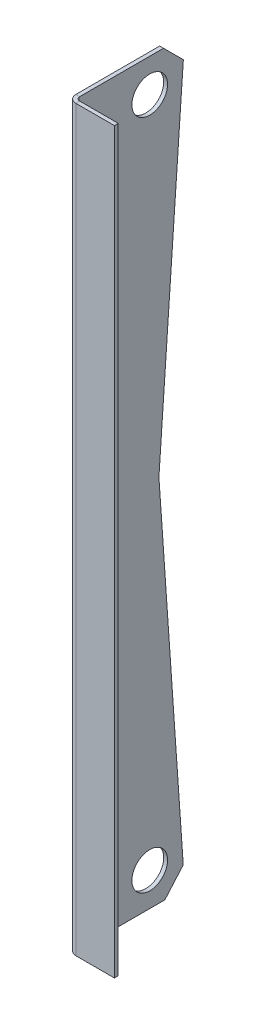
ISO-10303-21;
HEADER;
FILE_DESCRIPTION(('STEP AP214'),'2;1');
FILE_NAME('part.step','',(''),(''),'','','');
FILE_SCHEMA(('AUTOMOTIVE_DESIGN { 1 0 10303 214 1 1 1 1 }'));
ENDSEC;
DATA;
#1=APPLICATION_CONTEXT('core data for automotive mechanical design processes');
#2=APPLICATION_PROTOCOL_DEFINITION('international standard','automotive_design',2000,#1);
#3=PRODUCT_CONTEXT('',#1,'mechanical');
#4=PRODUCT('Part','Part','',(#3));
#5=PRODUCT_RELATED_PRODUCT_CATEGORY('part','',(#4));
#6=PRODUCT_DEFINITION_FORMATION('','',#4);
#7=PRODUCT_DEFINITION_CONTEXT('part definition',#1,'design');
#8=PRODUCT_DEFINITION('design','',#6,#7);
#9=PRODUCT_DEFINITION_SHAPE('','',#8);
#10=(LENGTH_UNIT() NAMED_UNIT(*) SI_UNIT(.MILLI.,.METRE.));
#11=(NAMED_UNIT(*) PLANE_ANGLE_UNIT() SI_UNIT($,.RADIAN.));
#12=(NAMED_UNIT(*) SI_UNIT($,.STERADIAN.) SOLID_ANGLE_UNIT());
#13=UNCERTAINTY_MEASURE_WITH_UNIT(LENGTH_MEASURE(1.E-05),#10,'distance_accuracy_value','');
#14=(GEOMETRIC_REPRESENTATION_CONTEXT(3) GLOBAL_UNCERTAINTY_ASSIGNED_CONTEXT((#13)) GLOBAL_UNIT_ASSIGNED_CONTEXT((#10,
#11,#12)) REPRESENTATION_CONTEXT('',''));
#15=CARTESIAN_POINT('',(0.,0.,0.));
#16=DIRECTION('',(0.,0.,1.));
#17=DIRECTION('',(1.,0.,0.));
#18=AXIS2_PLACEMENT_3D('',#15,#16,#17);
#19=CARTESIAN_POINT('',(6.35000000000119,608.012500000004,-185.737500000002));
#20=DIRECTION('',(1.,0.,0.));
#21=DIRECTION('',(0.,0.,-1.));
#22=AXIS2_PLACEMENT_3D('',#19,#20,#21);
#23=PLANE('',#22);
#24=CARTESIAN_POINT('',(6.34999999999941,553.243750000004,-128.055813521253));
#25=DIRECTION('',(1.,0.,0.));
#26=DIRECTION('',(0.,0.,-1.));
#27=AXIS2_PLACEMENT_3D('',#24,#25,#26);
#28=CIRCLE('',#27,29.3687499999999);
#29=CARTESIAN_POINT('',(6.34999999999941,553.243750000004,-98.6870635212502));
#30=VERTEX_POINT('',#29);
#31=EDGE_CURVE('E319',#30,#30,#28,.T.);
#32=ORIENTED_EDGE('',*,*,#31,.F.);
#33=EDGE_LOOP('',(#32));
#34=FACE_BOUND('',#33,.T.);
#35=CARTESIAN_POINT('',(6.35000000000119,-553.243749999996,-128.055813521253));
#36=DIRECTION('',(1.,0.,0.));
#37=DIRECTION('',(0.,0.,-1.));
#38=AXIS2_PLACEMENT_3D('',#35,#36,#37);
#39=CIRCLE('',#38,29.36875);
#40=CARTESIAN_POINT('',(6.35000000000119,-553.243749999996,-98.6870635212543));
#41=VERTEX_POINT('',#40);
#42=EDGE_CURVE('E144',#41,#41,#39,.T.);
#43=ORIENTED_EDGE('',*,*,#42,.F.);
#44=EDGE_LOOP('',(#43));
#45=FACE_BOUND('',#44,.T.);
#46=DIRECTION('',(0.,0.,1.));
#47=VECTOR('',#46,1.);
#48=CARTESIAN_POINT('',(6.34999999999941,-608.012499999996,-185.737500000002));
#49=LINE('',#48,#47);
#50=CARTESIAN_POINT('',(6.34999999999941,-608.012499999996,-153.015370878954));
#51=VERTEX_POINT('',#50);
#52=CARTESIAN_POINT('',(6.34999999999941,-608.012499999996,-12.7));
#53=VERTEX_POINT('',#52);
#54=EDGE_CURVE('E177',#51,#53,#49,.T.);
#55=ORIENTED_EDGE('',*,*,#54,.F.);
#56=DIRECTION('',(0.,-0.754709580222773,0.656059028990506));
#57=VECTOR('',#56,1.);
#58=CARTESIAN_POINT('',(6.34999999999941,100.820824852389,-769.194779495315));
#59=LINE('',#58,#57);
#60=CARTESIAN_POINT('',(6.34999999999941,-573.172575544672,-183.30125515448));
#61=VERTEX_POINT('',#60);
#62=EDGE_CURVE('E138',#51,#61,#59,.F.);
#63=ORIENTED_EDGE('',*,*,#62,.T.);
#64=DIRECTION('',(0.,-0.997564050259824,-0.0697564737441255));
#65=VECTOR('',#64,1.);
#66=CARTESIAN_POINT('',(6.34999999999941,6.75077980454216E-13,-143.221124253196));
#67=LINE('',#66,#65);
#68=CARTESIAN_POINT('',(6.34999999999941,6.75077980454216E-13,-143.221124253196));
#69=VERTEX_POINT('',#68);
#70=EDGE_CURVE('E126',#69,#61,#67,.T.);
#71=ORIENTED_EDGE('',*,*,#70,.F.);
#72=DIRECTION('',(0.,-0.997564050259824,0.0697564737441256));
#73=VECTOR('',#72,1.);
#74=CARTESIAN_POINT('',(6.35000000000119,608.012500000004,-185.737500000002));
#75=LINE('',#74,#73);
#76=CARTESIAN_POINT('',(6.34999999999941,575.370080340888,-183.45491965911));
#77=VERTEX_POINT('',#76);
#78=EDGE_CURVE('E119',#77,#69,#75,.T.);
#79=ORIENTED_EDGE('',*,*,#78,.F.);
#80=DIRECTION('',(0.,0.707106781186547,0.707106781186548));
#81=VECTOR('',#80,1.);
#82=CARTESIAN_POINT('',(6.35000000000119,590.550000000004,-168.275));
#83=LINE('',#82,#81);
#84=CARTESIAN_POINT('',(6.35000000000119,608.012500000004,-150.8125));
#85=VERTEX_POINT('',#84);
#86=EDGE_CURVE('E211',#77,#85,#83,.T.);
#87=ORIENTED_EDGE('',*,*,#86,.T.);
#88=DIRECTION('',(0.,0.,1.));
#89=VECTOR('',#88,1.);
#90=CARTESIAN_POINT('',(6.35000000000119,608.012500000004,-185.737500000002));
#91=LINE('',#90,#89);
#92=CARTESIAN_POINT('',(6.35000000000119,608.012500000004,-12.7));
#93=VERTEX_POINT('',#92);
#94=EDGE_CURVE('E158',#85,#93,#91,.T.);
#95=ORIENTED_EDGE('',*,*,#94,.T.);
#96=DIRECTION('',(0.,-1.,0.));
#97=VECTOR('',#96,1.);
#98=CARTESIAN_POINT('',(6.35000000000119,608.012500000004,-12.7));
#99=LINE('',#98,#97);
#100=EDGE_CURVE('E188',#93,#53,#99,.T.);
#101=ORIENTED_EDGE('',*,*,#100,.T.);
#102=EDGE_LOOP('',(#55,#63,#71,#79,#87,#95,#101));
#103=FACE_BOUND('',#102,.T.);
#104=ADVANCED_FACE('F36',(#34,#45,#103),#23,.T.);
#105=CARTESIAN_POINT('',(0.,608.012500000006,-185.737500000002));
#106=DIRECTION('',(1.,0.,0.));
#107=DIRECTION('',(0.,0.,-1.));
#108=AXIS2_PLACEMENT_3D('',#105,#106,#107);
#109=PLANE('',#108);
#110=CARTESIAN_POINT('',(0.,553.243750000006,-128.055813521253));
#111=DIRECTION('',(-1.,0.,0.));
#112=DIRECTION('',(0.,0.,1.));
#113=AXIS2_PLACEMENT_3D('',#110,#111,#112);
#114=CIRCLE('',#113,29.3687499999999);
#115=CARTESIAN_POINT('',(0.,553.243750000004,-98.6870635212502));
#116=VERTEX_POINT('',#115);
#117=EDGE_CURVE('E322',#116,#116,#114,.T.);
#118=ORIENTED_EDGE('',*,*,#117,.F.);
#119=EDGE_LOOP('',(#118));
#120=FACE_BOUND('',#119,.T.);
#121=CARTESIAN_POINT('',(0.,-553.243749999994,-128.055813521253));
#122=DIRECTION('',(-1.,0.,0.));
#123=DIRECTION('',(0.,0.,1.));
#124=AXIS2_PLACEMENT_3D('',#121,#122,#123);
#125=CIRCLE('',#124,29.36875);
#126=CARTESIAN_POINT('',(0.,-553.243749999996,-98.6870635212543));
#127=VERTEX_POINT('',#126);
#128=EDGE_CURVE('E324',#127,#127,#125,.T.);
#129=ORIENTED_EDGE('',*,*,#128,.F.);
#130=EDGE_LOOP('',(#129));
#131=FACE_BOUND('',#130,.T.);
#132=DIRECTION('',(0.,-0.997564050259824,-0.0697564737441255));
#133=VECTOR('',#132,1.);
#134=CARTESIAN_POINT('',(0.,6.75077980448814E-13,-143.221124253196));
#135=LINE('',#134,#133);
#136=CARTESIAN_POINT('',(0.,6.75077980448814E-13,-143.221124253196));
#137=VERTEX_POINT('',#136);
#138=CARTESIAN_POINT('',(0.,-573.17257554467,-183.30125515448));
#139=VERTEX_POINT('',#138);
#140=EDGE_CURVE('E127',#137,#139,#135,.T.);
#141=ORIENTED_EDGE('',*,*,#140,.T.);
#142=DIRECTION('',(0.,0.754709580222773,-0.656059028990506));
#143=VECTOR('',#142,1.);
#144=CARTESIAN_POINT('',(0.,-608.012499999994,-153.015370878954));
#145=LINE('',#144,#143);
#146=CARTESIAN_POINT('',(0.,-608.012499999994,-153.015370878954));
#147=VERTEX_POINT('',#146);
#148=EDGE_CURVE('E217',#139,#147,#145,.F.);
#149=ORIENTED_EDGE('',*,*,#148,.T.);
#150=DIRECTION('',(0.,0.,1.));
#151=VECTOR('',#150,1.);
#152=CARTESIAN_POINT('',(0.,-608.012499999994,-185.737500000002));
#153=LINE('',#152,#151);
#154=CARTESIAN_POINT('',(0.,-608.012499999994,-12.7));
#155=VERTEX_POINT('',#154);
#156=EDGE_CURVE('E179',#147,#155,#153,.T.);
#157=ORIENTED_EDGE('',*,*,#156,.T.);
#158=DIRECTION('',(0.,-1.,0.));
#159=VECTOR('',#158,1.);
#160=CARTESIAN_POINT('',(0.,608.012500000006,-12.7));
#161=LINE('',#160,#159);
#162=CARTESIAN_POINT('',(0.,608.012500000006,-12.7));
#163=VERTEX_POINT('',#162);
#164=EDGE_CURVE('E185',#163,#155,#161,.T.);
#165=ORIENTED_EDGE('',*,*,#164,.F.);
#166=DIRECTION('',(0.,0.,1.));
#167=VECTOR('',#166,1.);
#168=CARTESIAN_POINT('',(0.,608.012500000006,-185.737500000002));
#169=LINE('',#168,#167);
#170=CARTESIAN_POINT('',(0.,608.012500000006,-150.8125));
#171=VERTEX_POINT('',#170);
#172=EDGE_CURVE('E160',#171,#163,#169,.T.);
#173=ORIENTED_EDGE('',*,*,#172,.F.);
#174=DIRECTION('',(0.,-0.707106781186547,-0.707106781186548));
#175=VECTOR('',#174,1.);
#176=CARTESIAN_POINT('',(0.,575.37008034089,-183.45491965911));
#177=LINE('',#176,#175);
#178=CARTESIAN_POINT('',(0.,575.37008034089,-183.45491965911));
#179=VERTEX_POINT('',#178);
#180=EDGE_CURVE('E51',#171,#179,#177,.T.);
#181=ORIENTED_EDGE('',*,*,#180,.T.);
#182=DIRECTION('',(0.,-0.997564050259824,0.0697564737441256));
#183=VECTOR('',#182,1.);
#184=CARTESIAN_POINT('',(0.,608.012500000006,-185.737500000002));
#185=LINE('',#184,#183);
#186=EDGE_CURVE('E142',#179,#137,#185,.T.);
#187=ORIENTED_EDGE('',*,*,#186,.T.);
#188=EDGE_LOOP('',(#141,#149,#157,#165,#173,#181,#187));
#189=FACE_BOUND('',#188,.T.);
#190=ADVANCED_FACE('F220',(#120,#131,#189),#109,.F.);
#191=CARTESIAN_POINT('',(0.,608.012500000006,-12.7));
#192=DIRECTION('',(0.,1.,0.));
#193=DIRECTION('',(0.,0.,1.));
#194=AXIS2_PLACEMENT_3D('',#191,#192,#193);
#195=PLANE('',#194);
#196=DIRECTION('',(1.,0.,0.));
#197=VECTOR('',#196,1.);
#198=CARTESIAN_POINT('',(0.,608.012500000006,-12.7));
#199=LINE('',#198,#197);
#200=EDGE_CURVE('E205',#163,#93,#199,.T.);
#201=ORIENTED_EDGE('',*,*,#200,.F.);
#202=CARTESIAN_POINT('',(12.7000000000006,608.012500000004,-12.7000000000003));
#203=DIRECTION('',(0.,-1.,0.));
#204=DIRECTION('',(0.,0.,-1.));
#205=AXIS2_PLACEMENT_3D('',#202,#203,#204);
#206=CIRCLE('',#205,12.7);
#207=CARTESIAN_POINT('',(12.7000000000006,608.012500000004,-2.4980018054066E-13));
#208=VERTEX_POINT('',#207);
#209=EDGE_CURVE('E162',#163,#208,#206,.F.);
#210=ORIENTED_EDGE('',*,*,#209,.T.);
#211=DIRECTION('',(0.,0.,1.));
#212=VECTOR('',#211,1.);
#213=CARTESIAN_POINT('',(12.7000000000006,608.012500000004,-6.35000000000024));
#214=LINE('',#213,#212);
#215=CARTESIAN_POINT('',(12.7000000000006,608.012500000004,-6.35000000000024));
#216=VERTEX_POINT('',#215);
#217=EDGE_CURVE('E203',#216,#208,#214,.T.);
#218=ORIENTED_EDGE('',*,*,#217,.F.);
#219=CARTESIAN_POINT('',(12.7000000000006,608.012500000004,-12.7000000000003));
#220=DIRECTION('',(0.,1.,0.));
#221=DIRECTION('',(1.,0.,0.));
#222=AXIS2_PLACEMENT_3D('',#219,#220,#221);
#223=CIRCLE('',#222,6.35);
#224=EDGE_CURVE('E155',#93,#216,#223,.T.);
#225=ORIENTED_EDGE('',*,*,#224,.F.);
#226=EDGE_LOOP('',(#201,#210,#218,#225));
#227=FACE_BOUND('',#226,.T.);
#228=ADVANCED_FACE('F243',(#227),#195,.T.);
#229=CARTESIAN_POINT('',(12.7000000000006,608.012500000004,-6.35000000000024));
#230=DIRECTION('',(0.,1.,0.));
#231=DIRECTION('',(0.,0.,1.));
#232=AXIS2_PLACEMENT_3D('',#229,#230,#231);
#233=PLANE('',#232);
#234=ORIENTED_EDGE('',*,*,#94,.F.);
#235=DIRECTION('',(-1.,0.,0.));
#236=VECTOR('',#235,1.);
#237=CARTESIAN_POINT('',(12.7000000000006,608.012500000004,-150.8125));
#238=LINE('',#237,#236);
#239=EDGE_CURVE('E11',#85,#171,#238,.T.);
#240=ORIENTED_EDGE('',*,*,#239,.T.);
#241=ORIENTED_EDGE('',*,*,#172,.T.);
#242=ORIENTED_EDGE('',*,*,#200,.T.);
#243=EDGE_LOOP('',(#234,#240,#241,#242));
#244=FACE_BOUND('',#243,.T.);
#245=ADVANCED_FACE('F274',(#244),#233,.T.);
#246=CARTESIAN_POINT('',(12.6999999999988,-608.012499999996,-2.4980018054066E-13));
#247=DIRECTION('',(0.,-1.,0.));
#248=DIRECTION('',(0.,0.,-1.));
#249=AXIS2_PLACEMENT_3D('',#246,#247,#248);
#250=PLANE('',#249);
#251=DIRECTION('',(0.,0.,-1.));
#252=VECTOR('',#251,1.);
#253=CARTESIAN_POINT('',(12.6999999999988,-608.012499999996,-2.4980018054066E-13));
#254=LINE('',#253,#252);
#255=CARTESIAN_POINT('',(12.6999999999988,-608.012499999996,-2.4980018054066E-13));
#256=VERTEX_POINT('',#255);
#257=CARTESIAN_POINT('',(12.6999999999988,-608.012499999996,-6.35000000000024));
#258=VERTEX_POINT('',#257);
#259=EDGE_CURVE('E201',#256,#258,#254,.T.);
#260=ORIENTED_EDGE('',*,*,#259,.F.);
#261=CARTESIAN_POINT('',(12.6999999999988,-608.012499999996,-12.7000000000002));
#262=DIRECTION('',(0.,-1.,0.));
#263=DIRECTION('',(0.,0.,-1.));
#264=AXIS2_PLACEMENT_3D('',#261,#262,#263);
#265=CIRCLE('',#264,12.7);
#266=EDGE_CURVE('E149',#155,#256,#265,.F.);
#267=ORIENTED_EDGE('',*,*,#266,.F.);
#268=DIRECTION('',(-1.,0.,0.));
#269=VECTOR('',#268,1.);
#270=CARTESIAN_POINT('',(6.34999999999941,-608.012499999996,-12.7));
#271=LINE('',#270,#269);
#272=EDGE_CURVE('E198',#53,#155,#271,.T.);
#273=ORIENTED_EDGE('',*,*,#272,.F.);
#274=CARTESIAN_POINT('',(12.6999999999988,-608.012499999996,-12.7000000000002));
#275=DIRECTION('',(0.,1.,0.));
#276=DIRECTION('',(1.,0.,0.));
#277=AXIS2_PLACEMENT_3D('',#274,#275,#276);
#278=CIRCLE('',#277,6.35);
#279=EDGE_CURVE('E174',#53,#258,#278,.T.);
#280=ORIENTED_EDGE('',*,*,#279,.T.);
#281=EDGE_LOOP('',(#260,#267,#273,#280));
#282=FACE_BOUND('',#281,.T.);
#283=ADVANCED_FACE('F270',(#282),#250,.T.);
#284=CARTESIAN_POINT('',(6.34999999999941,-608.012499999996,-12.7));
#285=DIRECTION('',(0.,-1.,0.));
#286=DIRECTION('',(0.,0.,-1.));
#287=AXIS2_PLACEMENT_3D('',#284,#285,#286);
#288=PLANE('',#287);
#289=DIRECTION('',(1.,0.,0.));
#290=VECTOR('',#289,1.);
#291=CARTESIAN_POINT('',(0.,-608.012499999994,0.));
#292=LINE('',#291,#290);
#293=CARTESIAN_POINT('',(76.2,-608.012499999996,1.2490009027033E-12));
#294=VERTEX_POINT('',#293);
#295=EDGE_CURVE('E135',#256,#294,#292,.T.);
#296=ORIENTED_EDGE('',*,*,#295,.F.);
#297=ORIENTED_EDGE('',*,*,#259,.T.);
#298=DIRECTION('',(1.,0.,0.));
#299=VECTOR('',#298,1.);
#300=CARTESIAN_POINT('',(0.,-608.012499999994,-6.34999999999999));
#301=LINE('',#300,#299);
#302=CARTESIAN_POINT('',(76.2,-608.012499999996,-6.34999999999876));
#303=VERTEX_POINT('',#302);
#304=EDGE_CURVE('E171',#258,#303,#301,.T.);
#305=ORIENTED_EDGE('',*,*,#304,.T.);
#306=DIRECTION('',(0.,0.,1.));
#307=VECTOR('',#306,1.);
#308=CARTESIAN_POINT('',(76.2,-608.012499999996,-6.34999999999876));
#309=LINE('',#308,#307);
#310=EDGE_CURVE('E168',#303,#294,#309,.T.);
#311=ORIENTED_EDGE('',*,*,#310,.T.);
#312=EDGE_LOOP('',(#296,#297,#305,#311));
#313=FACE_BOUND('',#312,.T.);
#314=ADVANCED_FACE('F266',(#313),#288,.T.);
#315=CARTESIAN_POINT('',(0.,608.012500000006,0.));
#316=DIRECTION('',(0.,0.,-1.));
#317=DIRECTION('',(-1.,0.,0.));
#318=AXIS2_PLACEMENT_3D('',#315,#316,#317);
#319=PLANE('',#318);
#320=ORIENTED_EDGE('',*,*,#295,.T.);
#321=DIRECTION('',(0.,-1.,0.));
#322=VECTOR('',#321,1.);
#323=CARTESIAN_POINT('',(76.2,608.012500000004,-1.2490009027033E-12));
#324=LINE('',#323,#322);
#325=CARTESIAN_POINT('',(76.2,608.012500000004,-1.2490009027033E-12));
#326=VERTEX_POINT('',#325);
#327=EDGE_CURVE('E196',#326,#294,#324,.T.);
#328=ORIENTED_EDGE('',*,*,#327,.F.);
#329=DIRECTION('',(1.,0.,0.));
#330=VECTOR('',#329,1.);
#331=CARTESIAN_POINT('',(0.,608.012500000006,0.));
#332=LINE('',#331,#330);
#333=EDGE_CURVE('E146',#208,#326,#332,.T.);
#334=ORIENTED_EDGE('',*,*,#333,.F.);
#335=DIRECTION('',(0.,-1.,0.));
#336=VECTOR('',#335,1.);
#337=CARTESIAN_POINT('',(12.7000000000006,608.012500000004,-2.4980018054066E-13));
#338=LINE('',#337,#336);
#339=EDGE_CURVE('E165',#208,#256,#338,.T.);
#340=ORIENTED_EDGE('',*,*,#339,.T.);
#341=EDGE_LOOP('',(#320,#328,#334,#340));
#342=FACE_BOUND('',#341,.T.);
#343=ADVANCED_FACE('F262',(#342),#319,.F.);
#344=CARTESIAN_POINT('',(76.2,608.012500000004,-6.35000000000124));
#345=DIRECTION('',(1.,0.,0.));
#346=DIRECTION('',(0.,0.,-1.));
#347=AXIS2_PLACEMENT_3D('',#344,#345,#346);
#348=PLANE('',#347);
#349=ORIENTED_EDGE('',*,*,#310,.F.);
#350=DIRECTION('',(0.,-1.,0.));
#351=VECTOR('',#350,1.);
#352=CARTESIAN_POINT('',(76.2,608.012500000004,-6.35000000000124));
#353=LINE('',#352,#351);
#354=CARTESIAN_POINT('',(76.2,608.012500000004,-6.35000000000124));
#355=VERTEX_POINT('',#354);
#356=EDGE_CURVE('E194',#355,#303,#353,.T.);
#357=ORIENTED_EDGE('',*,*,#356,.F.);
#358=DIRECTION('',(0.,0.,1.));
#359=VECTOR('',#358,1.);
#360=CARTESIAN_POINT('',(76.2,608.012500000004,-6.35000000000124));
#361=LINE('',#360,#359);
#362=EDGE_CURVE('E148',#355,#326,#361,.T.);
#363=ORIENTED_EDGE('',*,*,#362,.T.);
#364=ORIENTED_EDGE('',*,*,#327,.T.);
#365=EDGE_LOOP('',(#349,#357,#363,#364));
#366=FACE_BOUND('',#365,.T.);
#367=ADVANCED_FACE('F258',(#366),#348,.T.);
#368=CARTESIAN_POINT('',(0.,608.012500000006,-6.35000000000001));
#369=DIRECTION('',(0.,0.,-1.));
#370=DIRECTION('',(-1.,0.,0.));
#371=AXIS2_PLACEMENT_3D('',#368,#369,#370);
#372=PLANE('',#371);
#373=ORIENTED_EDGE('',*,*,#304,.F.);
#374=DIRECTION('',(0.,-1.,0.));
#375=VECTOR('',#374,1.);
#376=CARTESIAN_POINT('',(12.7000000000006,608.012500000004,-6.35000000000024));
#377=LINE('',#376,#375);
#378=EDGE_CURVE('E191',#216,#258,#377,.T.);
#379=ORIENTED_EDGE('',*,*,#378,.F.);
#380=DIRECTION('',(1.,0.,0.));
#381=VECTOR('',#380,1.);
#382=CARTESIAN_POINT('',(0.,608.012500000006,-6.35000000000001));
#383=LINE('',#382,#381);
#384=EDGE_CURVE('E152',#216,#355,#383,.T.);
#385=ORIENTED_EDGE('',*,*,#384,.T.);
#386=ORIENTED_EDGE('',*,*,#356,.T.);
#387=EDGE_LOOP('',(#373,#379,#385,#386));
#388=FACE_BOUND('',#387,.T.);
#389=ADVANCED_FACE('F254',(#388),#372,.T.);
#390=CARTESIAN_POINT('',(12.7000000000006,608.012500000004,-12.7000000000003));
#391=DIRECTION('',(0.,-1.,0.));
#392=DIRECTION('',(0.,0.,-1.));
#393=AXIS2_PLACEMENT_3D('',#390,#391,#392);
#394=CYLINDRICAL_SURFACE('',#393,6.35);
#395=ORIENTED_EDGE('',*,*,#279,.F.);
#396=ORIENTED_EDGE('',*,*,#100,.F.);
#397=ORIENTED_EDGE('',*,*,#224,.T.);
#398=ORIENTED_EDGE('',*,*,#378,.T.);
#399=EDGE_LOOP('',(#395,#396,#397,#398));
#400=FACE_BOUND('',#399,.T.);
#401=ADVANCED_FACE('F250',(#400),#394,.F.);
#402=CARTESIAN_POINT('',(12.7000000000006,608.012500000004,-12.7000000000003));
#403=DIRECTION('',(0.,-1.,0.));
#404=DIRECTION('',(0.,0.,-1.));
#405=AXIS2_PLACEMENT_3D('',#402,#403,#404);
#406=CYLINDRICAL_SURFACE('',#405,12.7);
#407=ORIENTED_EDGE('',*,*,#266,.T.);
#408=ORIENTED_EDGE('',*,*,#339,.F.);
#409=ORIENTED_EDGE('',*,*,#209,.F.);
#410=ORIENTED_EDGE('',*,*,#164,.T.);
#411=EDGE_LOOP('',(#407,#408,#409,#410));
#412=FACE_BOUND('',#411,.T.);
#413=ADVANCED_FACE('F253',(#412),#406,.T.);
#414=CARTESIAN_POINT('',(12.7000000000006,608.012500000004,-12.7000000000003));
#415=DIRECTION('',(0.,1.,0.));
#416=DIRECTION('',(1.,0.,0.));
#417=AXIS2_PLACEMENT_3D('',#414,#415,#416);
#418=PLANE('',#417);
#419=ORIENTED_EDGE('',*,*,#333,.T.);
#420=ORIENTED_EDGE('',*,*,#362,.F.);
#421=ORIENTED_EDGE('',*,*,#384,.F.);
#422=ORIENTED_EDGE('',*,*,#217,.T.);
#423=EDGE_LOOP('',(#419,#420,#421,#422));
#424=FACE_BOUND('',#423,.T.);
#425=ADVANCED_FACE('F293',(#424),#418,.T.);
#426=CARTESIAN_POINT('',(12.6999999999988,-608.012499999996,-12.7000000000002));
#427=DIRECTION('',(0.,1.,0.));
#428=DIRECTION('',(1.,0.,0.));
#429=AXIS2_PLACEMENT_3D('',#426,#427,#428);
#430=PLANE('',#429);
#431=ORIENTED_EDGE('',*,*,#156,.F.);
#432=DIRECTION('',(1.,0.,0.));
#433=VECTOR('',#432,1.);
#434=CARTESIAN_POINT('',(6.34999999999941,-608.012499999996,-153.015370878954));
#435=LINE('',#434,#433);
#436=EDGE_CURVE('E208',#147,#51,#435,.T.);
#437=ORIENTED_EDGE('',*,*,#436,.T.);
#438=ORIENTED_EDGE('',*,*,#54,.T.);
#439=ORIENTED_EDGE('',*,*,#272,.T.);
#440=EDGE_LOOP('',(#431,#437,#438,#439));
#441=FACE_BOUND('',#440,.T.);
#442=ADVANCED_FACE('F225',(#441),#430,.F.);
#443=CARTESIAN_POINT('',(0.,6.75077980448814E-13,-143.221124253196));
#444=DIRECTION('',(0.,-0.0697564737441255,0.997564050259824));
#445=DIRECTION('',(0.,-0.997564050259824,-0.0697564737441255));
#446=AXIS2_PLACEMENT_3D('',#443,#444,#445);
#447=PLANE('',#446);
#448=ORIENTED_EDGE('',*,*,#70,.T.);
#449=DIRECTION('',(1.,0.,0.));
#450=VECTOR('',#449,1.);
#451=CARTESIAN_POINT('',(0.,-573.17257554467,-183.30125515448));
#452=LINE('',#451,#450);
#453=EDGE_CURVE('E214',#61,#139,#452,.F.);
#454=ORIENTED_EDGE('',*,*,#453,.T.);
#455=ORIENTED_EDGE('',*,*,#140,.F.);
#456=DIRECTION('',(-1.,0.,0.));
#457=VECTOR('',#456,1.);
#458=CARTESIAN_POINT('',(0.,6.75077980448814E-13,-143.221124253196));
#459=LINE('',#458,#457);
#460=EDGE_CURVE('E122',#137,#69,#459,.F.);
#461=ORIENTED_EDGE('',*,*,#460,.T.);
#462=EDGE_LOOP('',(#448,#454,#455,#461));
#463=FACE_BOUND('',#462,.T.);
#464=ADVANCED_FACE('F132',(#463),#447,.F.);
#465=CARTESIAN_POINT('',(0.,608.012500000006,-185.737500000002));
#466=DIRECTION('',(0.,0.0697564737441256,0.997564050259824));
#467=DIRECTION('',(0.,-0.997564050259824,0.0697564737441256));
#468=AXIS2_PLACEMENT_3D('',#465,#466,#467);
#469=PLANE('',#468);
#470=ORIENTED_EDGE('',*,*,#186,.F.);
#471=DIRECTION('',(-1.,0.,0.));
#472=VECTOR('',#471,1.);
#473=CARTESIAN_POINT('',(0.,575.37008034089,-183.45491965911));
#474=LINE('',#473,#472);
#475=EDGE_CURVE('E44',#179,#77,#474,.F.);
#476=ORIENTED_EDGE('',*,*,#475,.T.);
#477=ORIENTED_EDGE('',*,*,#78,.T.);
#478=ORIENTED_EDGE('',*,*,#460,.F.);
#479=EDGE_LOOP('',(#470,#476,#477,#478));
#480=FACE_BOUND('',#479,.T.);
#481=ADVANCED_FACE('F121',(#480),#469,.F.);
#482=CARTESIAN_POINT('',(12.6999999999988,-608.012499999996,-153.015370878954));
#483=DIRECTION('',(0.,0.656059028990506,0.754709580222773));
#484=DIRECTION('',(0.,-0.754709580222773,0.656059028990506));
#485=AXIS2_PLACEMENT_3D('',#482,#483,#484);
#486=PLANE('',#485);
#487=ORIENTED_EDGE('',*,*,#148,.F.);
#488=ORIENTED_EDGE('',*,*,#453,.F.);
#489=ORIENTED_EDGE('',*,*,#62,.F.);
#490=ORIENTED_EDGE('',*,*,#436,.F.);
#491=EDGE_LOOP('',(#487,#488,#489,#490));
#492=FACE_BOUND('',#491,.T.);
#493=ADVANCED_FACE('F227',(#492),#486,.F.);
#494=CARTESIAN_POINT('',(0.,575.37008034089,-183.45491965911));
#495=DIRECTION('',(0.,0.707106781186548,-0.707106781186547));
#496=DIRECTION('',(0.,0.707106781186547,0.707106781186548));
#497=AXIS2_PLACEMENT_3D('',#494,#495,#496);
#498=PLANE('',#497);
#499=ORIENTED_EDGE('',*,*,#180,.F.);
#500=ORIENTED_EDGE('',*,*,#239,.F.);
#501=ORIENTED_EDGE('',*,*,#86,.F.);
#502=ORIENTED_EDGE('',*,*,#475,.F.);
#503=EDGE_LOOP('',(#499,#500,#501,#502));
#504=FACE_BOUND('',#503,.T.);
#505=ADVANCED_FACE('F38',(#504),#498,.T.);
#506=CARTESIAN_POINT('',(76.2,-553.243749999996,-128.055813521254));
#507=DIRECTION('',(-1.,0.,0.));
#508=DIRECTION('',(0.,0.,1.));
#509=AXIS2_PLACEMENT_3D('',#506,#507,#508);
#510=CYLINDRICAL_SURFACE('',#509,29.36875);
#511=CARTESIAN_POINT('',(6.35000000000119,-553.243749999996,-98.6870635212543));
#512=CARTESIAN_POINT('',(6.28385416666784,-553.243749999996,-98.6870635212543));
#513=CARTESIAN_POINT('',(6.2177083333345,-553.243749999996,-98.6870635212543));
#514=CARTESIAN_POINT('',(6.0854166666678,-553.243749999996,-98.6870635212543));
#515=CARTESIAN_POINT('',(6.01927083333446,-553.243749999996,-98.6870635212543));
#516=CARTESIAN_POINT('',(5.88697916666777,-553.243749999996,-98.6870635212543));
#517=CARTESIAN_POINT('',(5.82083333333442,-553.243749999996,-98.6870635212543));
#518=CARTESIAN_POINT('',(5.68854166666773,-553.243749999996,-98.6870635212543));
#519=CARTESIAN_POINT('',(5.62239583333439,-553.243749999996,-98.6870635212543));
#520=CARTESIAN_POINT('',(5.49010416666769,-553.243749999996,-98.6870635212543));
#521=CARTESIAN_POINT('',(5.42395833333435,-553.243749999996,-98.6870635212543));
#522=CARTESIAN_POINT('',(5.29166666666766,-553.243749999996,-98.6870635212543));
#523=CARTESIAN_POINT('',(5.22552083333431,-553.243749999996,-98.6870635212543));
#524=CARTESIAN_POINT('',(5.09322916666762,-553.243749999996,-98.6870635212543));
#525=CARTESIAN_POINT('',(5.02708333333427,-553.243749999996,-98.6870635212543));
#526=CARTESIAN_POINT('',(4.89479166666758,-553.243749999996,-98.6870635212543));
#527=CARTESIAN_POINT('',(4.82864583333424,-553.243749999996,-98.6870635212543));
#528=CARTESIAN_POINT('',(4.69635416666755,-553.243749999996,-98.6870635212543));
#529=CARTESIAN_POINT('',(4.6302083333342,-553.243749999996,-98.6870635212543));
#530=CARTESIAN_POINT('',(4.49791666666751,-553.243749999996,-98.6870635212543));
#531=CARTESIAN_POINT('',(4.43177083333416,-553.243749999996,-98.6870635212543));
#532=CARTESIAN_POINT('',(4.29947916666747,-553.243749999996,-98.6870635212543));
#533=CARTESIAN_POINT('',(4.23333333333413,-553.243749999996,-98.6870635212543));
#534=CARTESIAN_POINT('',(4.10104166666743,-553.243749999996,-98.6870635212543));
#535=CARTESIAN_POINT('',(4.03489583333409,-553.243749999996,-98.6870635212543));
#536=CARTESIAN_POINT('',(3.9026041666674,-553.243749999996,-98.6870635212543));
#537=CARTESIAN_POINT('',(3.83645833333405,-553.243749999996,-98.6870635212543));
#538=CARTESIAN_POINT('',(3.70416666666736,-553.243749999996,-98.6870635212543));
#539=CARTESIAN_POINT('',(3.63802083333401,-553.243749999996,-98.6870635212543));
#540=CARTESIAN_POINT('',(3.50572916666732,-553.243749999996,-98.6870635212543));
#541=CARTESIAN_POINT('',(3.43958333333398,-553.243749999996,-98.6870635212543));
#542=CARTESIAN_POINT('',(3.30729166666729,-553.243749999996,-98.6870635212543));
#543=CARTESIAN_POINT('',(3.24114583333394,-553.243749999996,-98.6870635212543));
#544=CARTESIAN_POINT('',(3.10885416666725,-553.243749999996,-98.6870635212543));
#545=CARTESIAN_POINT('',(3.0427083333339,-553.243749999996,-98.6870635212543));
#546=CARTESIAN_POINT('',(2.91041666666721,-553.243749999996,-98.6870635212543));
#547=CARTESIAN_POINT('',(2.84427083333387,-553.243749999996,-98.6870635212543));
#548=CARTESIAN_POINT('',(2.71197916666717,-553.243749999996,-98.6870635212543));
#549=CARTESIAN_POINT('',(2.64583333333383,-553.243749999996,-98.6870635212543));
#550=CARTESIAN_POINT('',(2.51354166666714,-553.243749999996,-98.6870635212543));
#551=CARTESIAN_POINT('',(2.44739583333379,-553.243749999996,-98.6870635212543));
#552=CARTESIAN_POINT('',(2.3151041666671,-553.243749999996,-98.6870635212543));
#553=CARTESIAN_POINT('',(2.24895833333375,-553.243749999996,-98.6870635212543));
#554=CARTESIAN_POINT('',(2.11666666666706,-553.243749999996,-98.6870635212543));
#555=CARTESIAN_POINT('',(2.05052083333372,-553.243749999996,-98.6870635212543));
#556=CARTESIAN_POINT('',(1.91822916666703,-553.243749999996,-98.6870635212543));
#557=CARTESIAN_POINT('',(1.85208333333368,-553.243749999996,-98.6870635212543));
#558=CARTESIAN_POINT('',(1.71979166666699,-553.243749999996,-98.6870635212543));
#559=CARTESIAN_POINT('',(1.65364583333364,-553.243749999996,-98.6870635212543));
#560=CARTESIAN_POINT('',(1.52135416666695,-553.243749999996,-98.6870635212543));
#561=CARTESIAN_POINT('',(1.45520833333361,-553.243749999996,-98.6870635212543));
#562=CARTESIAN_POINT('',(1.32291666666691,-553.243749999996,-98.6870635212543));
#563=CARTESIAN_POINT('',(1.25677083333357,-553.243749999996,-98.6870635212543));
#564=CARTESIAN_POINT('',(1.12447916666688,-553.243749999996,-98.6870635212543));
#565=CARTESIAN_POINT('',(1.05833333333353,-553.243749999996,-98.6870635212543));
#566=CARTESIAN_POINT('',(0.92604166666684,-553.243749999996,-98.6870635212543));
#567=CARTESIAN_POINT('',(0.859895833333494,-553.243749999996,-98.6870635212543));
#568=CARTESIAN_POINT('',(0.727604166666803,-553.243749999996,-98.6870635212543));
#569=CARTESIAN_POINT('',(0.661458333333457,-553.243749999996,-98.6870635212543));
#570=CARTESIAN_POINT('',(0.529166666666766,-553.243749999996,-98.6870635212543));
#571=CARTESIAN_POINT('',(0.46302083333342,-553.243749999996,-98.6870635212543));
#572=CARTESIAN_POINT('',(0.330729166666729,-553.243749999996,-98.6870635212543));
#573=CARTESIAN_POINT('',(0.264583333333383,-553.243749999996,-98.6870635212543));
#574=CARTESIAN_POINT('',(0.132291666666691,-553.243749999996,-98.6870635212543));
#575=CARTESIAN_POINT('',(0.0661458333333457,-553.243749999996,-98.6870635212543));
#576=CARTESIAN_POINT('',(0.,-553.243749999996,-98.6870635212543));
#577=B_SPLINE_CURVE_WITH_KNOTS('',3,(#511,#512,#513,#514,#515,#516,#517,#518,#519,#520,#521,
#522,#523,#524,#525,#526,#527,#528,#529,#530,#531,#532,#533,#534,#535,#536,#537,#538,#539,#540,
#541,#542,#543,#544,#545,#546,#547,#548,#549,#550,#551,#552,#553,#554,#555,#556,#557,#558,#559,
#560,#561,#562,#563,#564,#565,#566,#567,#568,#569,#570,#571,#572,#573,#574,#575,#576),
.UNSPECIFIED.,.F.,.F.,(4,2,2,2,2,2,2,2,2,2,2,2,2,2,2,2,2,2,2,2,2,2,2,2,2,2,2,2,2,2,2,2,4),(0.,
0.198437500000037,0.396875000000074,0.595312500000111,0.793750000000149,0.992187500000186,
1.19062500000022,1.38906250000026,1.5875000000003,1.78593750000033,1.98437500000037,
2.18281250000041,2.38125000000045,2.57968750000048,2.77812500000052,2.97656250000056,
3.17500000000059,3.37343750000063,3.57187500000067,3.77031250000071,3.96875000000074,
4.16718750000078,4.36562500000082,4.56406250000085,4.76250000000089,4.96093750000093,
5.15937500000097,5.357812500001,5.55625000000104,5.75468750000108,5.95312500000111,
6.15156250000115,6.35000000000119),.UNSPECIFIED.);
#578=EDGE_CURVE('BSEAM233',#41,#127,#577,.T.);
#579=ORIENTED_EDGE('',*,*,#42,.T.);
#580=ORIENTED_EDGE('',*,*,#128,.T.);
#581=ORIENTED_EDGE('',*,*,#578,.T.);
#582=ORIENTED_EDGE('',*,*,#578,.F.);
#583=EDGE_LOOP('',(#579,#581,#580,#582));
#584=FACE_BOUND('',#583,.T.);
#585=ADVANCED_FACE('F233',(#584),#510,.F.);
#586=CARTESIAN_POINT('',(76.2,553.243750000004,-128.05581352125));
#587=DIRECTION('',(-1.,0.,0.));
#588=DIRECTION('',(0.,0.,1.));
#589=AXIS2_PLACEMENT_3D('',#586,#587,#588);
#590=CYLINDRICAL_SURFACE('',#589,29.3687499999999);
#591=CARTESIAN_POINT('',(6.34999999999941,553.243750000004,-98.6870635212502));
#592=CARTESIAN_POINT('',(6.28385416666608,553.243750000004,-98.6870635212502));
#593=CARTESIAN_POINT('',(6.21770833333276,553.243750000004,-98.6870635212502));
#594=CARTESIAN_POINT('',(6.0854166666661,553.243750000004,-98.6870635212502));
#595=CARTESIAN_POINT('',(6.01927083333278,553.243750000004,-98.6870635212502));
#596=CARTESIAN_POINT('',(5.88697916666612,553.243750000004,-98.6870635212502));
#597=CARTESIAN_POINT('',(5.82083333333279,553.243750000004,-98.6870635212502));
#598=CARTESIAN_POINT('',(5.68854166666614,553.243750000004,-98.6870635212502));
#599=CARTESIAN_POINT('',(5.62239583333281,553.243750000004,-98.6870635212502));
#600=CARTESIAN_POINT('',(5.49010416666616,553.243750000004,-98.6870635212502));
#601=CARTESIAN_POINT('',(5.42395833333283,553.243750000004,-98.6870635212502));
#602=CARTESIAN_POINT('',(5.29166666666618,553.243750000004,-98.6870635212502));
#603=CARTESIAN_POINT('',(5.22552083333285,553.243750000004,-98.6870635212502));
#604=CARTESIAN_POINT('',(5.09322916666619,553.243750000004,-98.6870635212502));
#605=CARTESIAN_POINT('',(5.02708333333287,553.243750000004,-98.6870635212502));
#606=CARTESIAN_POINT('',(4.89479166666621,553.243750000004,-98.6870635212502));
#607=CARTESIAN_POINT('',(4.82864583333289,553.243750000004,-98.6870635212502));
#608=CARTESIAN_POINT('',(4.69635416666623,553.243750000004,-98.6870635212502));
#609=CARTESIAN_POINT('',(4.6302083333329,553.243750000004,-98.6870635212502));
#610=CARTESIAN_POINT('',(4.49791666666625,553.243750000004,-98.6870635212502));
#611=CARTESIAN_POINT('',(4.43177083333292,553.243750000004,-98.6870635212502));
#612=CARTESIAN_POINT('',(4.29947916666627,553.243750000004,-98.6870635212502));
#613=CARTESIAN_POINT('',(4.23333333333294,553.243750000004,-98.6870635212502));
#614=CARTESIAN_POINT('',(4.10104166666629,553.243750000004,-98.6870635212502));
#615=CARTESIAN_POINT('',(4.03489583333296,553.243750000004,-98.6870635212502));
#616=CARTESIAN_POINT('',(3.9026041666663,553.243750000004,-98.6870635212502));
#617=CARTESIAN_POINT('',(3.83645833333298,553.243750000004,-98.6870635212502));
#618=CARTESIAN_POINT('',(3.70416666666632,553.243750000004,-98.6870635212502));
#619=CARTESIAN_POINT('',(3.638020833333,553.243750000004,-98.6870635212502));
#620=CARTESIAN_POINT('',(3.50572916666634,553.243750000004,-98.6870635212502));
#621=CARTESIAN_POINT('',(3.43958333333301,553.243750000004,-98.6870635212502));
#622=CARTESIAN_POINT('',(3.30729166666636,553.243750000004,-98.6870635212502));
#623=CARTESIAN_POINT('',(3.24114583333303,553.243750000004,-98.6870635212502));
#624=CARTESIAN_POINT('',(3.10885416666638,553.243750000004,-98.6870635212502));
#625=CARTESIAN_POINT('',(3.04270833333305,553.243750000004,-98.6870635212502));
#626=CARTESIAN_POINT('',(2.9104166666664,553.243750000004,-98.6870635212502));
#627=CARTESIAN_POINT('',(2.84427083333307,553.243750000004,-98.6870635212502));
#628=CARTESIAN_POINT('',(2.71197916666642,553.243750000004,-98.6870635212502));
#629=CARTESIAN_POINT('',(2.64583333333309,553.243750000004,-98.6870635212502));
#630=CARTESIAN_POINT('',(2.51354166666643,553.243750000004,-98.6870635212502));
#631=CARTESIAN_POINT('',(2.44739583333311,553.243750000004,-98.6870635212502));
#632=CARTESIAN_POINT('',(2.31510416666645,553.243750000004,-98.6870635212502));
#633=CARTESIAN_POINT('',(2.24895833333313,553.243750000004,-98.6870635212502));
#634=CARTESIAN_POINT('',(2.11666666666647,553.243750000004,-98.6870635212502));
#635=CARTESIAN_POINT('',(2.05052083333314,553.243750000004,-98.6870635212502));
#636=CARTESIAN_POINT('',(1.91822916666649,553.243750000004,-98.6870635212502));
#637=CARTESIAN_POINT('',(1.85208333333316,553.243750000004,-98.6870635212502));
#638=CARTESIAN_POINT('',(1.71979166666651,553.243750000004,-98.6870635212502));
#639=CARTESIAN_POINT('',(1.65364583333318,553.243750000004,-98.6870635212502));
#640=CARTESIAN_POINT('',(1.52135416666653,553.243750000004,-98.6870635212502));
#641=CARTESIAN_POINT('',(1.4552083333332,553.243750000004,-98.6870635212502));
#642=CARTESIAN_POINT('',(1.32291666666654,553.243750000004,-98.6870635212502));
#643=CARTESIAN_POINT('',(1.25677083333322,553.243750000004,-98.6870635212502));
#644=CARTESIAN_POINT('',(1.12447916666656,553.243750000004,-98.6870635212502));
#645=CARTESIAN_POINT('',(1.05833333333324,553.243750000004,-98.6870635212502));
#646=CARTESIAN_POINT('',(0.926041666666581,553.243750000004,-98.6870635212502));
#647=CARTESIAN_POINT('',(0.859895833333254,553.243750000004,-98.6870635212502));
#648=CARTESIAN_POINT('',(0.727604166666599,553.243750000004,-98.6870635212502));
#649=CARTESIAN_POINT('',(0.661458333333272,553.243750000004,-98.6870635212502));
#650=CARTESIAN_POINT('',(0.529166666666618,553.243750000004,-98.6870635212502));
#651=CARTESIAN_POINT('',(0.46302083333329,553.243750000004,-98.6870635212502));
#652=CARTESIAN_POINT('',(0.330729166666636,553.243750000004,-98.6870635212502));
#653=CARTESIAN_POINT('',(0.264583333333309,553.243750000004,-98.6870635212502));
#654=CARTESIAN_POINT('',(0.132291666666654,553.243750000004,-98.6870635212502));
#655=CARTESIAN_POINT('',(0.0661458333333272,553.243750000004,-98.6870635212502));
#656=CARTESIAN_POINT('',(0.,553.243750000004,-98.6870635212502));
#657=B_SPLINE_CURVE_WITH_KNOTS('',3,(#591,#592,#593,#594,#595,#596,#597,#598,#599,#600,#601,
#602,#603,#604,#605,#606,#607,#608,#609,#610,#611,#612,#613,#614,#615,#616,#617,#618,#619,#620,
#621,#622,#623,#624,#625,#626,#627,#628,#629,#630,#631,#632,#633,#634,#635,#636,#637,#638,#639,
#640,#641,#642,#643,#644,#645,#646,#647,#648,#649,#650,#651,#652,#653,#654,#655,#656),
.UNSPECIFIED.,.F.,.F.,(4,2,2,2,2,2,2,2,2,2,2,2,2,2,2,2,2,2,2,2,2,2,2,2,2,2,2,2,2,2,2,2,4),(0.,
0.198437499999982,0.396874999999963,0.595312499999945,0.793749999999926,0.992187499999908,
1.19062499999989,1.38906249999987,1.58749999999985,1.78593749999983,1.98437499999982,
2.1828124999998,2.38124999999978,2.57968749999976,2.77812499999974,2.97656249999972,
3.17499999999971,3.37343749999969,3.57187499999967,3.77031249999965,3.96874999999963,
4.16718749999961,4.3656249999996,4.56406249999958,4.76249999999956,4.96093749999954,
5.15937499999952,5.3578124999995,5.55624999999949,5.75468749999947,5.95312499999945,
6.15156249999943,6.34999999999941),.UNSPECIFIED.);
#658=EDGE_CURVE('BSEAM311',#30,#116,#657,.T.);
#659=ORIENTED_EDGE('',*,*,#31,.T.);
#660=ORIENTED_EDGE('',*,*,#117,.T.);
#661=ORIENTED_EDGE('',*,*,#658,.T.);
#662=ORIENTED_EDGE('',*,*,#658,.F.);
#663=EDGE_LOOP('',(#659,#661,#660,#662));
#664=FACE_BOUND('',#663,.T.);
#665=ADVANCED_FACE('F311',(#664),#590,.F.);
#666=CLOSED_SHELL('',(#104,#190,#228,#245,#283,#314,#343,#367,#389,#401,#413,#425,#442,#464,
#481,#493,#505,#585,#665));
#667=MANIFOLD_SOLID_BREP('B2',#666);
#668=ADVANCED_BREP_SHAPE_REPRESENTATION('',(#18,#667),#14);
#669=SHAPE_DEFINITION_REPRESENTATION(#9,#668);
ENDSEC;
END-ISO-10303-21;
